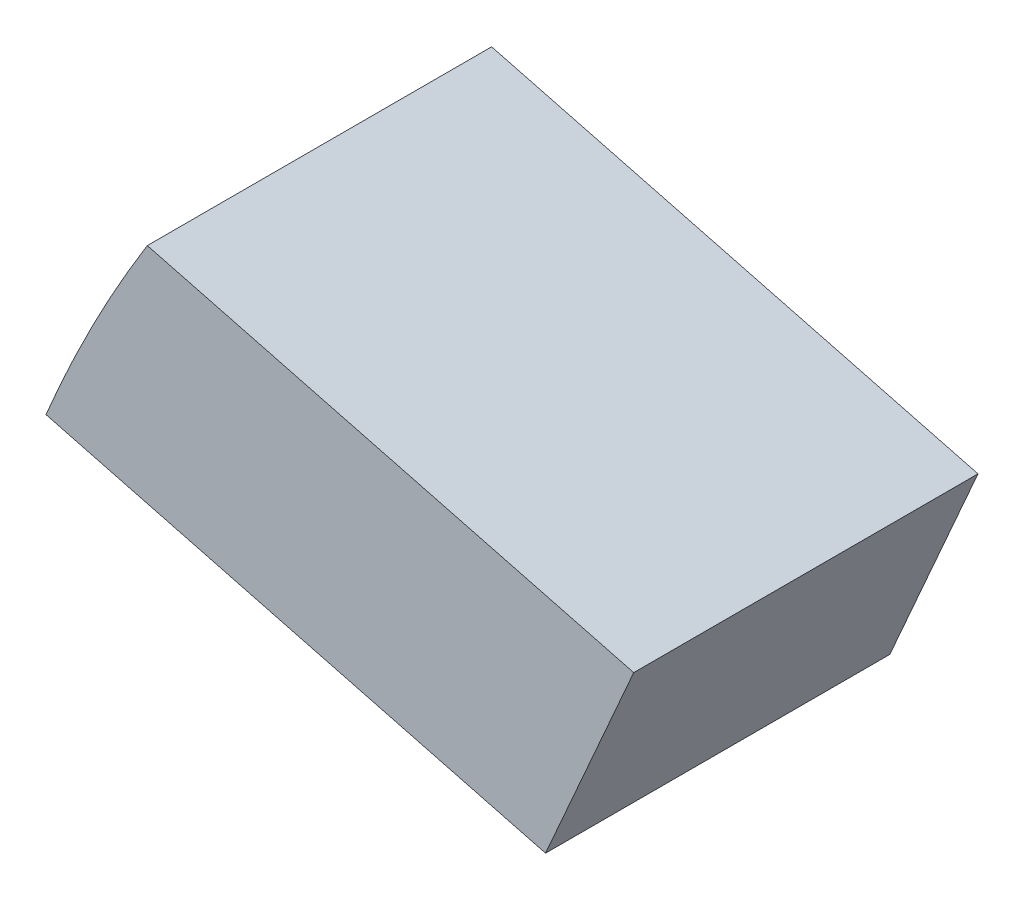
from build123d import *

# Parameters (mm, degrees)
BOSS_EXTRUDE1_DEPTH = 6.35


with BuildPart() as part:
    # Sketch1 → Boss-Extrude1 (new body)
    with BuildSketch(Plane.XY):
        with BuildLine():
            Line((-10.663604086, 6.897647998), (-12.290298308, 3.199776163))
            Line((-12.290298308, 3.199776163), (-21.504124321, 5.598593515))
            add(Edge.make_bspline(
                [(-19.634991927, 9.233346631), (-20.715393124, 7.491676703), (-21.504124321, 5.598593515)],
                knots=[0, 0, 0, 1, 1, 1], degree=2))
            Line((-19.634991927, 9.233346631), (-10.663604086, 6.897647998))
        make_face()
    extrude(amount=BOSS_EXTRUDE1_DEPTH)


solid = part.part
